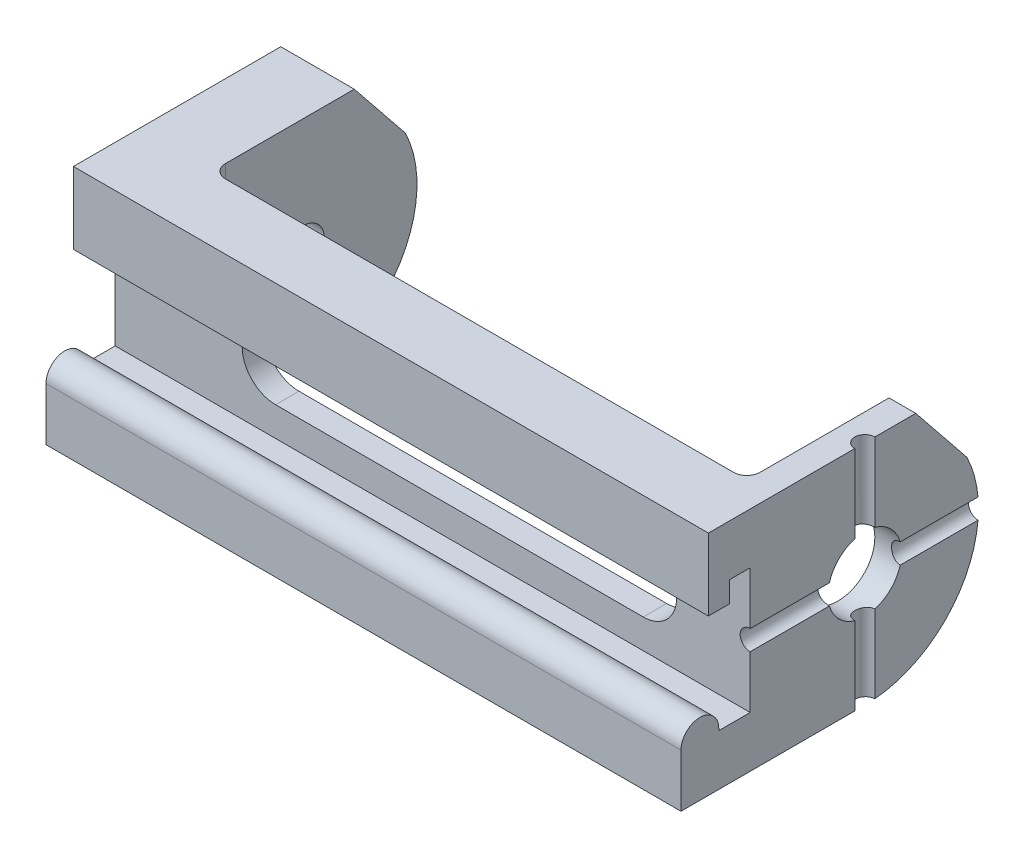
from build123d import *

# Parameters (mm, degrees)
BOSS_EXTRUDE1_DEPTH     = 48.26
CUT_EXTRUDE2_START      = -2.032
SKETCH5_W               = 16.51
SKETCH5_H               = 17.272
CUT_EXTRUDE2_DEPTH      = 40.64
FILLET1_R               = 1.016
CUT_EXTRUDE3_REACH      = 54.005
CUT_EXTRUDE4_REACH      = 52.978
SKETCH7_R               = 1.5875
CUT_EXTRUDE5_REACH      = 52.978
SKETCH8_R               = 2.794
CUT_EXTRUDE6_REACH      = 52.978
SKETCH9_W               = 4.7244
SKETCH9_H               = 4.064
FILLET2_R               = 0.254
FILLET3_R               = 0.381
FILLET4_RADIUS          = 1.4351
FILLET4_LENGTH          = 48.26
CUT_EXTRUDE7_DEPTH      = 51.978122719
CUT_EXTRUDE7_DEPTH_BACK = 51.978122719
SKETCH10_R              = 0.762
CUT_EXTRUDE8_DEPTH      = 51.978122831
CUT_EXTRUDE8_DEPTH_BACK = 51.978122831
SKETCH11_R              = 0.762


with BuildPart() as part:
    # Sketch1 → Boss-Extrude1 (new body)
    with BuildSketch(Plane(origin=(0, 0, 0), x_dir=(0, 0, -1), z_dir=(1, 0, 0))):
        with BuildLine():
            Line((0, -8.636), (-13.97, -8.636))
            Line((-13.97, -8.636), (-13.97, -3.175))
            Line((-13.97, -3.175), (-11.0998, -3.175))
            Line((-11.0998, -3.175), (-11.0998, -4.7625))
            Line((-11.0998, -4.7625), (-8.7122, -4.7625))
            Line((-8.7122, -4.7625), (-8.7122, 4.7625))
            Line((-8.7122, 4.7625), (-10.287, 4.7625))
            Line((-10.287, 4.7625), (-10.287, 3.175))
            Line((-10.287, 3.175), (-11.8872, 3.175))
            Line((-11.8872, 3.175), (-11.8872, 8.636))
            Line((-11.8872, 8.636), (3.8735, 8.636))
            Line((3.8735, 8.636), (7.747591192, 3.815144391))
            ThreePointArc((7.747591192, 3.815144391), (7.332396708, -4.56250529), (0, -8.636))
        make_face()
    extrude(amount=BOSS_EXTRUDE1_DEPTH)

    # Sketch5 → Cut-Extrude2 (cut)
    with BuildSketch(Plane(origin=(48.26, 0, 0), x_dir=(0, 0, -1), z_dir=(1, 0, 0)).offset(CUT_EXTRUDE2_START)):
        with Locations((1.3208, 0)):
            Rectangle(SKETCH5_W, SKETCH5_H)
    extrude(amount=-CUT_EXTRUDE2_DEPTH, mode=Mode.SUBTRACT)

    # Fillet1
    fillet1_edges = [part.edges().sort_by_distance(p)[0] for p in [
        (46.228, 0, 6.9342),
        (5.588, 0, 6.9342),
    ]]
    fillet(fillet1_edges, radius=FILLET1_R)

    # Sketch6 → Cut-Extrude3 (cut, up to next)
    with BuildSketch(Plane.XY.offset(8.7122), mode=Mode.PRIVATE) as cut_extrude3_sk1:
        with BuildLine():
            Line((12.192, 2.54), (40.132, 2.54))
            ThreePointArc((40.132, 2.54), (42.672, 0), (40.132, -2.54))
            Line((40.132, -2.54), (12.192, -2.54))
            ThreePointArc((12.192, -2.54), (9.652, 0), (12.192, 2.54))
        make_face()
    cut_extrude3_tool1 = extrude(cut_extrude3_sk1.sketch, amount=-CUT_EXTRUDE3_REACH, mode=Mode.PRIVATE) & part.part
    add(cut_extrude3_tool1.solids().sort_by_distance((26.162, 0, 8.7122))[0], mode=Mode.SUBTRACT)

    # Sketch7 → Cut-Extrude4 (cut, up to next)
    with BuildSketch(Plane.ZY, mode=Mode.PRIVATE) as cut_extrude4_sk1:
        Circle(SKETCH7_R)
    cut_extrude4_tool1 = extrude(cut_extrude4_sk1.sketch, amount=-CUT_EXTRUDE4_REACH, mode=Mode.PRIVATE) & part.part
    add(cut_extrude4_tool1.solids().sort_by_distance((0, 0, 0))[0], mode=Mode.SUBTRACT)

    # Sketch8 → Cut-Extrude5 (cut, up to next)
    with BuildSketch(Plane(origin=(48.26, 0, 0), x_dir=(0, 0, -1), z_dir=(1, 0, 0)), mode=Mode.PRIVATE) as cut_extrude5_sk1:
        Circle(SKETCH8_R)
    cut_extrude5_tool1 = extrude(cut_extrude5_sk1.sketch, amount=-CUT_EXTRUDE5_REACH, mode=Mode.PRIVATE) & part.part
    add(cut_extrude5_tool1.solids().sort_by_distance((48.26, 0, 0))[0], mode=Mode.SUBTRACT)

    # Sketch9 → Cut-Extrude6 (cut, up to next)
    with BuildSketch(Plane.ZY, mode=Mode.PRIVATE) as cut_extrude6_sk1:
        with Locations((0, -6.604)):
            Rectangle(SKETCH9_W, SKETCH9_H)
    cut_extrude6_tool1 = extrude(cut_extrude6_sk1.sketch, amount=-CUT_EXTRUDE6_REACH, mode=Mode.PRIVATE) & part.part
    add(cut_extrude6_tool1.solids().sort_by_distance((0, -6.604, 0))[0], mode=Mode.SUBTRACT)

    # Fillet2
    fillet2_edges = [part.edges().sort_by_distance(p)[0] for p in [
        (2.794, -8.30665439, -2.3622),
        (2.794, -8.636, 2.3622),
    ]]
    fillet(fillet2_edges, radius=FILLET2_R)

    # Fillet3
    fillet3_edges = [part.edges().sort_by_distance(p)[0] for p in [
        (2.794, -4.572, 2.3622),
        (2.794, -4.572, -2.3622),
    ]]
    fillet(fillet3_edges, radius=FILLET3_R)

    # Fillet4: full round fillet: the end face becomes a half cylinder, R = half its width
    fillet4_face = Plane((24.13, -3.175, 12.5349), x_dir=(1, 0, 0), z_dir=(0, 1, 0))  # on the end face: x along it, z out of the body
    fillet4_slab = fillet4_face.offset(-FILLET4_RADIUS / 2) * Box(FILLET4_LENGTH, 2 * FILLET4_RADIUS, FILLET4_RADIUS, mode=Mode.PRIVATE)  # the body's end, R deep
    fillet4_round = Plane((24.13, -4.6101, 12.5349), x_dir=(0, 1, 0), z_dir=(1, 0, 0)) * Cylinder(FILLET4_RADIUS, FILLET4_LENGTH, mode=Mode.PRIVATE)  # its axis R under the face
    add(fillet4_slab - fillet4_round, mode=Mode.SUBTRACT)

    # Sketch10 → Cut-Extrude7 (cut, two sides: drawn at the far end of the back side and taken through both)
    with BuildSketch(Plane.XY.offset(-CUT_EXTRUDE7_DEPTH_BACK)):
        with Locations((48.26, 0)):
            Circle(SKETCH10_R)
    extrude(amount=CUT_EXTRUDE7_DEPTH + CUT_EXTRUDE7_DEPTH_BACK, mode=Mode.SUBTRACT)

    # Sketch11 → Cut-Extrude8 (cut, two sides: drawn at the far end of the back side and taken through both)
    with BuildSketch(Plane(origin=(0, 0, 0), x_dir=(1, 0, 0), z_dir=(0, 1, 0)).offset(-CUT_EXTRUDE8_DEPTH_BACK)):
        with Locations((48.26, 0)):
            Circle(SKETCH11_R)
    extrude(amount=CUT_EXTRUDE8_DEPTH + CUT_EXTRUDE8_DEPTH_BACK, mode=Mode.SUBTRACT)


solid = part.part
